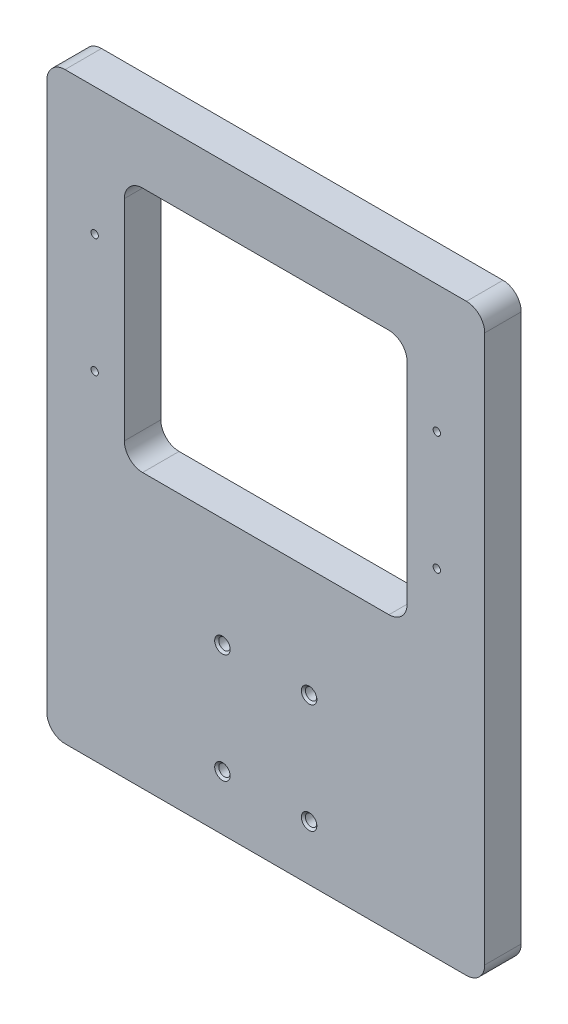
ISO-10303-21;
HEADER;
FILE_DESCRIPTION(('STEP AP214'),'2;1');
FILE_NAME('part.step','',(''),(''),'','','');
FILE_SCHEMA(('AUTOMOTIVE_DESIGN { 1 0 10303 214 1 1 1 1 }'));
ENDSEC;
DATA;
#1=APPLICATION_CONTEXT('core data for automotive mechanical design processes');
#2=APPLICATION_PROTOCOL_DEFINITION('international standard','automotive_design',2000,#1);
#3=PRODUCT_CONTEXT('',#1,'mechanical');
#4=PRODUCT('Part','Part','',(#3));
#5=PRODUCT_RELATED_PRODUCT_CATEGORY('part','',(#4));
#6=PRODUCT_DEFINITION_FORMATION('','',#4);
#7=PRODUCT_DEFINITION_CONTEXT('part definition',#1,'design');
#8=PRODUCT_DEFINITION('design','',#6,#7);
#9=PRODUCT_DEFINITION_SHAPE('','',#8);
#10=(LENGTH_UNIT() NAMED_UNIT(*) SI_UNIT(.MILLI.,.METRE.));
#11=(NAMED_UNIT(*) PLANE_ANGLE_UNIT() SI_UNIT($,.RADIAN.));
#12=(NAMED_UNIT(*) SI_UNIT($,.STERADIAN.) SOLID_ANGLE_UNIT());
#13=UNCERTAINTY_MEASURE_WITH_UNIT(LENGTH_MEASURE(1.E-05),#10,'distance_accuracy_value','');
#14=(GEOMETRIC_REPRESENTATION_CONTEXT(3) GLOBAL_UNCERTAINTY_ASSIGNED_CONTEXT((#13)) GLOBAL_UNIT_ASSIGNED_CONTEXT((#10,
#11,#12)) REPRESENTATION_CONTEXT('',''));
#15=CARTESIAN_POINT('',(0.,0.,0.));
#16=DIRECTION('',(0.,0.,1.));
#17=DIRECTION('',(1.,0.,0.));
#18=AXIS2_PLACEMENT_3D('',#15,#16,#17);
#19=CARTESIAN_POINT('',(0.,0.,25.4));
#20=DIRECTION('',(-1.,0.,0.));
#21=DIRECTION('',(0.,0.,1.));
#22=AXIS2_PLACEMENT_3D('',#19,#20,#21);
#23=PLANE('',#22);
#24=DIRECTION('',(0.,1.,0.));
#25=VECTOR('',#24,1.);
#26=CARTESIAN_POINT('',(0.,0.,0.));
#27=LINE('',#26,#25);
#28=CARTESIAN_POINT('',(0.,12.7,0.));
#29=VERTEX_POINT('',#28);
#30=CARTESIAN_POINT('',(0.,393.7,0.));
#31=VERTEX_POINT('',#30);
#32=EDGE_CURVE('E280',#29,#31,#27,.T.);
#33=ORIENTED_EDGE('',*,*,#32,.F.);
#34=DIRECTION('',(0.,0.,-1.));
#35=VECTOR('',#34,1.);
#36=CARTESIAN_POINT('',(0.,12.7,25.4));
#37=LINE('',#36,#35);
#38=CARTESIAN_POINT('',(0.,12.7,25.4));
#39=VERTEX_POINT('',#38);
#40=EDGE_CURVE('E318',#29,#39,#37,.F.);
#41=ORIENTED_EDGE('',*,*,#40,.T.);
#42=DIRECTION('',(0.,1.,0.));
#43=VECTOR('',#42,1.);
#44=CARTESIAN_POINT('',(0.,0.,25.4));
#45=LINE('',#44,#43);
#46=CARTESIAN_POINT('',(0.,393.7,25.4));
#47=VERTEX_POINT('',#46);
#48=EDGE_CURVE('E281',#39,#47,#45,.T.);
#49=ORIENTED_EDGE('',*,*,#48,.T.);
#50=DIRECTION('',(0.,0.,-1.));
#51=VECTOR('',#50,1.);
#52=CARTESIAN_POINT('',(0.,393.7,25.4));
#53=LINE('',#52,#51);
#54=EDGE_CURVE('E315',#47,#31,#53,.T.);
#55=ORIENTED_EDGE('',*,*,#54,.T.);
#56=EDGE_LOOP('',(#33,#41,#49,#55));
#57=FACE_BOUND('',#56,.T.);
#58=ADVANCED_FACE('F40',(#57),#23,.T.);
#59=CARTESIAN_POINT('',(0.,0.,25.4));
#60=DIRECTION('',(0.,1.,0.));
#61=DIRECTION('',(0.,0.,1.));
#62=AXIS2_PLACEMENT_3D('',#59,#60,#61);
#63=PLANE('',#62);
#64=DIRECTION('',(1.,0.,0.));
#65=VECTOR('',#64,1.);
#66=CARTESIAN_POINT('',(0.,0.,25.4));
#67=LINE('',#66,#65);
#68=CARTESIAN_POINT('',(12.7,0.,25.4));
#69=VERTEX_POINT('',#68);
#70=CARTESIAN_POINT('',(292.1,0.,25.4));
#71=VERTEX_POINT('',#70);
#72=EDGE_CURVE('E289',#69,#71,#67,.T.);
#73=ORIENTED_EDGE('',*,*,#72,.F.);
#74=DIRECTION('',(0.,0.,-1.));
#75=VECTOR('',#74,1.);
#76=CARTESIAN_POINT('',(12.7,0.,0.));
#77=LINE('',#76,#75);
#78=CARTESIAN_POINT('',(12.7,0.,0.));
#79=VERTEX_POINT('',#78);
#80=EDGE_CURVE('E304',#69,#79,#77,.T.);
#81=ORIENTED_EDGE('',*,*,#80,.T.);
#82=DIRECTION('',(1.,0.,0.));
#83=VECTOR('',#82,1.);
#84=CARTESIAN_POINT('',(0.,0.,0.));
#85=LINE('',#84,#83);
#86=CARTESIAN_POINT('',(292.1,0.,0.));
#87=VERTEX_POINT('',#86);
#88=EDGE_CURVE('E285',#79,#87,#85,.T.);
#89=ORIENTED_EDGE('',*,*,#88,.T.);
#90=DIRECTION('',(0.,0.,-1.));
#91=VECTOR('',#90,1.);
#92=CARTESIAN_POINT('',(292.1,0.,25.4));
#93=LINE('',#92,#91);
#94=EDGE_CURVE('E292',#87,#71,#93,.F.);
#95=ORIENTED_EDGE('',*,*,#94,.T.);
#96=EDGE_LOOP('',(#73,#81,#89,#95));
#97=FACE_BOUND('',#96,.T.);
#98=ADVANCED_FACE('F359',(#97),#63,.F.);
#99=CARTESIAN_POINT('',(304.8,0.,25.4));
#100=DIRECTION('',(-1.,0.,0.));
#101=DIRECTION('',(0.,0.,1.));
#102=AXIS2_PLACEMENT_3D('',#99,#100,#101);
#103=PLANE('',#102);
#104=DIRECTION('',(0.,1.,0.));
#105=VECTOR('',#104,1.);
#106=CARTESIAN_POINT('',(304.8,0.,25.4));
#107=LINE('',#106,#105);
#108=CARTESIAN_POINT('',(304.8,12.7,25.4));
#109=VERTEX_POINT('',#108);
#110=CARTESIAN_POINT('',(304.8,393.7,25.4));
#111=VERTEX_POINT('',#110);
#112=EDGE_CURVE('E287',#109,#111,#107,.T.);
#113=ORIENTED_EDGE('',*,*,#112,.F.);
#114=DIRECTION('',(0.,0.,-1.));
#115=VECTOR('',#114,1.);
#116=CARTESIAN_POINT('',(304.8,12.7,25.4));
#117=LINE('',#116,#115);
#118=CARTESIAN_POINT('',(304.8,12.7,0.));
#119=VERTEX_POINT('',#118);
#120=EDGE_CURVE('E329',#109,#119,#117,.T.);
#121=ORIENTED_EDGE('',*,*,#120,.T.);
#122=DIRECTION('',(0.,1.,0.));
#123=VECTOR('',#122,1.);
#124=CARTESIAN_POINT('',(304.8,0.,0.));
#125=LINE('',#124,#123);
#126=CARTESIAN_POINT('',(304.8,393.7,0.));
#127=VERTEX_POINT('',#126);
#128=EDGE_CURVE('E298',#119,#127,#125,.T.);
#129=ORIENTED_EDGE('',*,*,#128,.T.);
#130=DIRECTION('',(0.,0.,-1.));
#131=VECTOR('',#130,1.);
#132=CARTESIAN_POINT('',(304.8,393.7,25.4));
#133=LINE('',#132,#131);
#134=EDGE_CURVE('E327',#127,#111,#133,.F.);
#135=ORIENTED_EDGE('',*,*,#134,.T.);
#136=EDGE_LOOP('',(#113,#121,#129,#135));
#137=FACE_BOUND('',#136,.T.);
#138=ADVANCED_FACE('F335',(#137),#103,.F.);
#139=CARTESIAN_POINT('',(0.,406.4,25.4));
#140=DIRECTION('',(0.,1.,0.));
#141=DIRECTION('',(0.,0.,1.));
#142=AXIS2_PLACEMENT_3D('',#139,#140,#141);
#143=PLANE('',#142);
#144=DIRECTION('',(1.,0.,0.));
#145=VECTOR('',#144,1.);
#146=CARTESIAN_POINT('',(0.,406.4,25.4));
#147=LINE('',#146,#145);
#148=CARTESIAN_POINT('',(12.7,406.4,25.4));
#149=VERTEX_POINT('',#148);
#150=CARTESIAN_POINT('',(292.1,406.4,25.4));
#151=VERTEX_POINT('',#150);
#152=EDGE_CURVE('E284',#149,#151,#147,.T.);
#153=ORIENTED_EDGE('',*,*,#152,.T.);
#154=DIRECTION('',(0.,0.,-1.));
#155=VECTOR('',#154,1.);
#156=CARTESIAN_POINT('',(292.1,406.4,0.));
#157=LINE('',#156,#155);
#158=CARTESIAN_POINT('',(292.1,406.4,0.));
#159=VERTEX_POINT('',#158);
#160=EDGE_CURVE('E11',#151,#159,#157,.T.);
#161=ORIENTED_EDGE('',*,*,#160,.T.);
#162=DIRECTION('',(1.,0.,0.));
#163=VECTOR('',#162,1.);
#164=CARTESIAN_POINT('',(0.,406.4,0.));
#165=LINE('',#164,#163);
#166=CARTESIAN_POINT('',(12.7,406.4,0.));
#167=VERTEX_POINT('',#166);
#168=EDGE_CURVE('E295',#167,#159,#165,.T.);
#169=ORIENTED_EDGE('',*,*,#168,.F.);
#170=DIRECTION('',(0.,0.,-1.));
#171=VECTOR('',#170,1.);
#172=CARTESIAN_POINT('',(12.7,406.4,25.4));
#173=LINE('',#172,#171);
#174=EDGE_CURVE('E48',#167,#149,#173,.F.);
#175=ORIENTED_EDGE('',*,*,#174,.T.);
#176=EDGE_LOOP('',(#153,#161,#169,#175));
#177=FACE_BOUND('',#176,.T.);
#178=ADVANCED_FACE('F344',(#177),#143,.T.);
#179=CARTESIAN_POINT('',(0.,0.,25.4));
#180=DIRECTION('',(0.,0.,-1.));
#181=DIRECTION('',(-1.,0.,0.));
#182=AXIS2_PLACEMENT_3D('',#179,#180,#181);
#183=PLANE('',#182);
#184=CARTESIAN_POINT('',(33.3375,317.5,25.4));
#185=DIRECTION('',(0.,0.,1.));
#186=DIRECTION('',(1.,0.,0.));
#187=AXIS2_PLACEMENT_3D('',#184,#185,#186);
#188=CIRCLE('',#187,2.5527);
#189=CARTESIAN_POINT('',(35.8902,317.5,25.4));
#190=VERTEX_POINT('',#189);
#191=EDGE_CURVE('E485',#190,#190,#188,.T.);
#192=ORIENTED_EDGE('',*,*,#191,.F.);
#193=EDGE_LOOP('',(#192));
#194=FACE_BOUND('',#193,.T.);
#195=CARTESIAN_POINT('',(271.4625,317.5,25.4));
#196=DIRECTION('',(0.,0.,1.));
#197=DIRECTION('',(1.,0.,0.));
#198=AXIS2_PLACEMENT_3D('',#195,#196,#197);
#199=CIRCLE('',#198,2.55270000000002);
#200=CARTESIAN_POINT('',(274.0152,317.5,25.4));
#201=VERTEX_POINT('',#200);
#202=EDGE_CURVE('E487',#201,#201,#199,.T.);
#203=ORIENTED_EDGE('',*,*,#202,.F.);
#204=EDGE_LOOP('',(#203));
#205=FACE_BOUND('',#204,.T.);
#206=CARTESIAN_POINT('',(271.4625,234.95,25.4));
#207=DIRECTION('',(0.,0.,1.));
#208=DIRECTION('',(1.,0.,0.));
#209=AXIS2_PLACEMENT_3D('',#206,#207,#208);
#210=CIRCLE('',#209,2.55270000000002);
#211=CARTESIAN_POINT('',(274.0152,234.95,25.4));
#212=VERTEX_POINT('',#211);
#213=EDGE_CURVE('E495',#212,#212,#210,.T.);
#214=ORIENTED_EDGE('',*,*,#213,.F.);
#215=EDGE_LOOP('',(#214));
#216=FACE_BOUND('',#215,.T.);
#217=CARTESIAN_POINT('',(33.3375,234.95,25.4));
#218=DIRECTION('',(0.,0.,1.));
#219=DIRECTION('',(1.,0.,0.));
#220=AXIS2_PLACEMENT_3D('',#217,#218,#219);
#221=CIRCLE('',#220,2.5527);
#222=CARTESIAN_POINT('',(35.8902,234.95,25.4));
#223=VERTEX_POINT('',#222);
#224=EDGE_CURVE('E500',#223,#223,#221,.T.);
#225=ORIENTED_EDGE('',*,*,#224,.F.);
#226=EDGE_LOOP('',(#225));
#227=FACE_BOUND('',#226,.T.);
#228=DIRECTION('',(1.,0.,0.));
#229=VECTOR('',#228,1.);
#230=CARTESIAN_POINT('',(66.675,190.5,25.4));
#231=LINE('',#230,#229);
#232=CARTESIAN_POINT('',(66.675,190.5,25.4));
#233=VERTEX_POINT('',#232);
#234=CARTESIAN_POINT('',(238.125,190.5,25.4));
#235=VERTEX_POINT('',#234);
#236=EDGE_CURVE('E203',#233,#235,#231,.T.);
#237=ORIENTED_EDGE('',*,*,#236,.F.);
#238=CARTESIAN_POINT('',(66.675,203.2,25.4));
#239=DIRECTION('',(0.,0.,1.));
#240=DIRECTION('',(-1.,0.,0.));
#241=AXIS2_PLACEMENT_3D('',#238,#239,#240);
#242=CIRCLE('',#241,12.7);
#243=CARTESIAN_POINT('',(53.975,203.2,25.4));
#244=VERTEX_POINT('',#243);
#245=EDGE_CURVE('E161',#244,#233,#242,.T.);
#246=ORIENTED_EDGE('',*,*,#245,.F.);
#247=DIRECTION('',(0.,-1.,0.));
#248=VECTOR('',#247,1.);
#249=CARTESIAN_POINT('',(53.975,203.2,25.4));
#250=LINE('',#249,#248);
#251=CARTESIAN_POINT('',(53.975,349.25,25.4));
#252=VERTEX_POINT('',#251);
#253=EDGE_CURVE('E180',#252,#244,#250,.T.);
#254=ORIENTED_EDGE('',*,*,#253,.F.);
#255=CARTESIAN_POINT('',(66.675,349.25,25.4));
#256=DIRECTION('',(0.,0.,1.));
#257=DIRECTION('',(-1.,0.,0.));
#258=AXIS2_PLACEMENT_3D('',#255,#256,#257);
#259=CIRCLE('',#258,12.6999999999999);
#260=CARTESIAN_POINT('',(66.675,361.95,25.4));
#261=VERTEX_POINT('',#260);
#262=EDGE_CURVE('E183',#261,#252,#259,.T.);
#263=ORIENTED_EDGE('',*,*,#262,.F.);
#264=DIRECTION('',(-1.,0.,0.));
#265=VECTOR('',#264,1.);
#266=CARTESIAN_POINT('',(66.675,361.95,25.4));
#267=LINE('',#266,#265);
#268=CARTESIAN_POINT('',(238.125,361.95,25.4));
#269=VERTEX_POINT('',#268);
#270=EDGE_CURVE('E214',#269,#261,#267,.T.);
#271=ORIENTED_EDGE('',*,*,#270,.F.);
#272=CARTESIAN_POINT('',(238.125,349.25,25.4));
#273=DIRECTION('',(0.,0.,1.));
#274=DIRECTION('',(-1.,0.,0.));
#275=AXIS2_PLACEMENT_3D('',#272,#273,#274);
#276=CIRCLE('',#275,12.7);
#277=CARTESIAN_POINT('',(250.825,349.25,25.4));
#278=VERTEX_POINT('',#277);
#279=EDGE_CURVE('E211',#278,#269,#276,.T.);
#280=ORIENTED_EDGE('',*,*,#279,.F.);
#281=DIRECTION('',(0.,1.,0.));
#282=VECTOR('',#281,1.);
#283=CARTESIAN_POINT('',(250.825,203.2,25.4));
#284=LINE('',#283,#282);
#285=CARTESIAN_POINT('',(250.825,203.2,25.4));
#286=VERTEX_POINT('',#285);
#287=EDGE_CURVE('E208',#286,#278,#284,.T.);
#288=ORIENTED_EDGE('',*,*,#287,.F.);
#289=CARTESIAN_POINT('',(238.125,203.2,25.4));
#290=DIRECTION('',(0.,0.,1.));
#291=DIRECTION('',(1.,0.,0.));
#292=AXIS2_PLACEMENT_3D('',#289,#290,#291);
#293=CIRCLE('',#292,12.7);
#294=EDGE_CURVE('E205',#235,#286,#293,.T.);
#295=ORIENTED_EDGE('',*,*,#294,.F.);
#296=EDGE_LOOP('',(#237,#246,#254,#263,#271,#280,#288,#295));
#297=FACE_BOUND('',#296,.T.);
#298=CARTESIAN_POINT('',(122.2375,38.1,25.4));
#299=DIRECTION('',(0.,0.,1.));
#300=DIRECTION('',(1.,0.,0.));
#301=AXIS2_PLACEMENT_3D('',#298,#299,#300);
#302=CIRCLE('',#301,5.3975);
#303=CARTESIAN_POINT('',(127.635,38.1,25.4));
#304=VERTEX_POINT('',#303);
#305=EDGE_CURVE('E235',#304,#304,#302,.T.);
#306=ORIENTED_EDGE('',*,*,#305,.F.);
#307=EDGE_LOOP('',(#306));
#308=FACE_BOUND('',#307,.T.);
#309=CARTESIAN_POINT('',(122.2375,114.3,25.4));
#310=DIRECTION('',(0.,0.,1.));
#311=DIRECTION('',(1.,0.,0.));
#312=AXIS2_PLACEMENT_3D('',#309,#310,#311);
#313=CIRCLE('',#312,5.3975);
#314=CARTESIAN_POINT('',(127.635,114.3,25.4));
#315=VERTEX_POINT('',#314);
#316=EDGE_CURVE('E247',#315,#315,#313,.T.);
#317=ORIENTED_EDGE('',*,*,#316,.F.);
#318=EDGE_LOOP('',(#317));
#319=FACE_BOUND('',#318,.T.);
#320=CARTESIAN_POINT('',(182.5625,38.1000000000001,25.4));
#321=DIRECTION('',(0.,0.,1.));
#322=DIRECTION('',(1.,0.,0.));
#323=AXIS2_PLACEMENT_3D('',#320,#321,#322);
#324=CIRCLE('',#323,5.3975);
#325=CARTESIAN_POINT('',(187.96,38.1000000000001,25.4));
#326=VERTEX_POINT('',#325);
#327=EDGE_CURVE('E259',#326,#326,#324,.T.);
#328=ORIENTED_EDGE('',*,*,#327,.F.);
#329=EDGE_LOOP('',(#328));
#330=FACE_BOUND('',#329,.T.);
#331=CARTESIAN_POINT('',(182.5625,114.3,25.4));
#332=DIRECTION('',(0.,0.,1.));
#333=DIRECTION('',(1.,0.,0.));
#334=AXIS2_PLACEMENT_3D('',#331,#332,#333);
#335=CIRCLE('',#334,5.3975);
#336=CARTESIAN_POINT('',(187.96,114.3,25.4));
#337=VERTEX_POINT('',#336);
#338=EDGE_CURVE('E271',#337,#337,#335,.T.);
#339=ORIENTED_EDGE('',*,*,#338,.F.);
#340=EDGE_LOOP('',(#339));
#341=FACE_BOUND('',#340,.T.);
#342=ORIENTED_EDGE('',*,*,#48,.F.);
#343=CARTESIAN_POINT('',(12.7,12.7,25.4));
#344=DIRECTION('',(0.,0.,-1.));
#345=DIRECTION('',(-1.,0.,0.));
#346=AXIS2_PLACEMENT_3D('',#343,#344,#345);
#347=CIRCLE('',#346,12.7);
#348=EDGE_CURVE('E325',#39,#69,#347,.F.);
#349=ORIENTED_EDGE('',*,*,#348,.T.);
#350=ORIENTED_EDGE('',*,*,#72,.T.);
#351=CARTESIAN_POINT('',(292.1,12.7,25.4));
#352=DIRECTION('',(0.,0.,-1.));
#353=DIRECTION('',(-1.,0.,0.));
#354=AXIS2_PLACEMENT_3D('',#351,#352,#353);
#355=CIRCLE('',#354,12.7);
#356=EDGE_CURVE('E323',#71,#109,#355,.F.);
#357=ORIENTED_EDGE('',*,*,#356,.T.);
#358=ORIENTED_EDGE('',*,*,#112,.T.);
#359=CARTESIAN_POINT('',(292.1,393.7,25.4));
#360=DIRECTION('',(0.,0.,-1.));
#361=DIRECTION('',(-1.,0.,0.));
#362=AXIS2_PLACEMENT_3D('',#359,#360,#361);
#363=CIRCLE('',#362,12.7);
#364=EDGE_CURVE('E55',#111,#151,#363,.F.);
#365=ORIENTED_EDGE('',*,*,#364,.T.);
#366=ORIENTED_EDGE('',*,*,#152,.F.);
#367=CARTESIAN_POINT('',(12.7,393.7,25.4));
#368=DIRECTION('',(0.,0.,-1.));
#369=DIRECTION('',(-1.,0.,0.));
#370=AXIS2_PLACEMENT_3D('',#367,#368,#369);
#371=CIRCLE('',#370,12.7);
#372=EDGE_CURVE('E320',#149,#47,#371,.F.);
#373=ORIENTED_EDGE('',*,*,#372,.T.);
#374=EDGE_LOOP('',(#342,#349,#350,#357,#358,#365,#366,#373));
#375=FACE_BOUND('',#374,.T.);
#376=ADVANCED_FACE('F347',(#194,#205,#216,#227,#297,#308,#319,#330,#341,#375),#183,.F.);
#377=CARTESIAN_POINT('',(0.,0.,0.));
#378=DIRECTION('',(0.,0.,-1.));
#379=DIRECTION('',(-1.,0.,0.));
#380=AXIS2_PLACEMENT_3D('',#377,#378,#379);
#381=PLANE('',#380);
#382=CARTESIAN_POINT('',(33.3375,317.5,0.));
#383=DIRECTION('',(0.,0.,1.));
#384=DIRECTION('',(1.,0.,0.));
#385=AXIS2_PLACEMENT_3D('',#382,#383,#384);
#386=CIRCLE('',#385,2.55269999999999);
#387=CARTESIAN_POINT('',(35.8902,317.5,0.));
#388=VERTEX_POINT('',#387);
#389=EDGE_CURVE('E482',#388,#388,#386,.T.);
#390=ORIENTED_EDGE('',*,*,#389,.T.);
#391=EDGE_LOOP('',(#390));
#392=FACE_BOUND('',#391,.T.);
#393=CARTESIAN_POINT('',(271.4625,317.5,0.));
#394=DIRECTION('',(0.,0.,1.));
#395=DIRECTION('',(1.,0.,0.));
#396=AXIS2_PLACEMENT_3D('',#393,#394,#395);
#397=CIRCLE('',#396,2.55270000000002);
#398=CARTESIAN_POINT('',(274.0152,317.5,0.));
#399=VERTEX_POINT('',#398);
#400=EDGE_CURVE('E492',#399,#399,#397,.T.);
#401=ORIENTED_EDGE('',*,*,#400,.T.);
#402=EDGE_LOOP('',(#401));
#403=FACE_BOUND('',#402,.T.);
#404=CARTESIAN_POINT('',(271.4625,234.95,0.));
#405=DIRECTION('',(0.,0.,1.));
#406=DIRECTION('',(1.,0.,0.));
#407=AXIS2_PLACEMENT_3D('',#404,#405,#406);
#408=CIRCLE('',#407,2.55270000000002);
#409=CARTESIAN_POINT('',(274.0152,234.95,0.));
#410=VERTEX_POINT('',#409);
#411=EDGE_CURVE('E498',#410,#410,#408,.T.);
#412=ORIENTED_EDGE('',*,*,#411,.T.);
#413=EDGE_LOOP('',(#412));
#414=FACE_BOUND('',#413,.T.);
#415=CARTESIAN_POINT('',(33.3375,234.95,0.));
#416=DIRECTION('',(0.,0.,1.));
#417=DIRECTION('',(1.,0.,0.));
#418=AXIS2_PLACEMENT_3D('',#415,#416,#417);
#419=CIRCLE('',#418,2.55269999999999);
#420=CARTESIAN_POINT('',(35.8902,234.95,0.));
#421=VERTEX_POINT('',#420);
#422=EDGE_CURVE('E186',#421,#421,#419,.T.);
#423=ORIENTED_EDGE('',*,*,#422,.T.);
#424=EDGE_LOOP('',(#423));
#425=FACE_BOUND('',#424,.T.);
#426=CARTESIAN_POINT('',(66.675,203.2,0.));
#427=DIRECTION('',(0.,0.,1.));
#428=DIRECTION('',(-1.,0.,0.));
#429=AXIS2_PLACEMENT_3D('',#426,#427,#428);
#430=CIRCLE('',#429,12.7);
#431=CARTESIAN_POINT('',(53.975,203.2,0.));
#432=VERTEX_POINT('',#431);
#433=CARTESIAN_POINT('',(66.675,190.5,0.));
#434=VERTEX_POINT('',#433);
#435=EDGE_CURVE('E158',#432,#434,#430,.T.);
#436=ORIENTED_EDGE('',*,*,#435,.T.);
#437=DIRECTION('',(1.,0.,0.));
#438=VECTOR('',#437,1.);
#439=CARTESIAN_POINT('',(66.675,190.5,0.));
#440=LINE('',#439,#438);
#441=CARTESIAN_POINT('',(238.125,190.5,0.));
#442=VERTEX_POINT('',#441);
#443=EDGE_CURVE('E170',#434,#442,#440,.T.);
#444=ORIENTED_EDGE('',*,*,#443,.T.);
#445=CARTESIAN_POINT('',(238.125,203.2,0.));
#446=DIRECTION('',(0.,0.,1.));
#447=DIRECTION('',(1.,0.,0.));
#448=AXIS2_PLACEMENT_3D('',#445,#446,#447);
#449=CIRCLE('',#448,12.7);
#450=CARTESIAN_POINT('',(250.825,203.2,0.));
#451=VERTEX_POINT('',#450);
#452=EDGE_CURVE('E174',#442,#451,#449,.T.);
#453=ORIENTED_EDGE('',*,*,#452,.T.);
#454=DIRECTION('',(0.,1.,0.));
#455=VECTOR('',#454,1.);
#456=CARTESIAN_POINT('',(250.825,203.2,0.));
#457=LINE('',#456,#455);
#458=CARTESIAN_POINT('',(250.825,349.25,0.));
#459=VERTEX_POINT('',#458);
#460=EDGE_CURVE('E190',#451,#459,#457,.T.);
#461=ORIENTED_EDGE('',*,*,#460,.T.);
#462=CARTESIAN_POINT('',(238.125,349.25,0.));
#463=DIRECTION('',(0.,0.,1.));
#464=DIRECTION('',(-1.,0.,0.));
#465=AXIS2_PLACEMENT_3D('',#462,#463,#464);
#466=CIRCLE('',#465,12.7);
#467=CARTESIAN_POINT('',(238.125,361.95,0.));
#468=VERTEX_POINT('',#467);
#469=EDGE_CURVE('E193',#459,#468,#466,.T.);
#470=ORIENTED_EDGE('',*,*,#469,.T.);
#471=DIRECTION('',(-1.,0.,0.));
#472=VECTOR('',#471,1.);
#473=CARTESIAN_POINT('',(66.675,361.95,0.));
#474=LINE('',#473,#472);
#475=CARTESIAN_POINT('',(66.675,361.95,0.));
#476=VERTEX_POINT('',#475);
#477=EDGE_CURVE('E196',#468,#476,#474,.T.);
#478=ORIENTED_EDGE('',*,*,#477,.T.);
#479=CARTESIAN_POINT('',(66.675,349.25,0.));
#480=DIRECTION('',(0.,0.,1.));
#481=DIRECTION('',(-1.,0.,0.));
#482=AXIS2_PLACEMENT_3D('',#479,#480,#481);
#483=CIRCLE('',#482,12.6999999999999);
#484=CARTESIAN_POINT('',(53.975,349.25,0.));
#485=VERTEX_POINT('',#484);
#486=EDGE_CURVE('E199',#476,#485,#483,.T.);
#487=ORIENTED_EDGE('',*,*,#486,.T.);
#488=DIRECTION('',(0.,-1.,0.));
#489=VECTOR('',#488,1.);
#490=CARTESIAN_POINT('',(53.975,203.2,0.));
#491=LINE('',#490,#489);
#492=EDGE_CURVE('E166',#485,#432,#491,.T.);
#493=ORIENTED_EDGE('',*,*,#492,.T.);
#494=EDGE_LOOP('',(#436,#444,#453,#461,#470,#478,#487,#493));
#495=FACE_BOUND('',#494,.T.);
#496=CARTESIAN_POINT('',(122.2375,38.1,0.));
#497=DIRECTION('',(0.,0.,1.));
#498=DIRECTION('',(1.,0.,0.));
#499=AXIS2_PLACEMENT_3D('',#496,#497,#498);
#500=CIRCLE('',#499,5.3975);
#501=CARTESIAN_POINT('',(127.635,38.1,0.));
#502=VERTEX_POINT('',#501);
#503=EDGE_CURVE('E221',#502,#502,#500,.T.);
#504=ORIENTED_EDGE('',*,*,#503,.T.);
#505=EDGE_LOOP('',(#504));
#506=FACE_BOUND('',#505,.T.);
#507=CARTESIAN_POINT('',(122.2375,114.3,0.));
#508=DIRECTION('',(0.,0.,1.));
#509=DIRECTION('',(1.,0.,0.));
#510=AXIS2_PLACEMENT_3D('',#507,#508,#509);
#511=CIRCLE('',#510,5.3975);
#512=CARTESIAN_POINT('',(127.635,114.3,0.));
#513=VERTEX_POINT('',#512);
#514=EDGE_CURVE('E244',#513,#513,#511,.T.);
#515=ORIENTED_EDGE('',*,*,#514,.T.);
#516=EDGE_LOOP('',(#515));
#517=FACE_BOUND('',#516,.T.);
#518=CARTESIAN_POINT('',(182.5625,38.1000000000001,0.));
#519=DIRECTION('',(0.,0.,1.));
#520=DIRECTION('',(1.,0.,0.));
#521=AXIS2_PLACEMENT_3D('',#518,#519,#520);
#522=CIRCLE('',#521,5.3975);
#523=CARTESIAN_POINT('',(187.96,38.1000000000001,0.));
#524=VERTEX_POINT('',#523);
#525=EDGE_CURVE('E256',#524,#524,#522,.T.);
#526=ORIENTED_EDGE('',*,*,#525,.T.);
#527=EDGE_LOOP('',(#526));
#528=FACE_BOUND('',#527,.T.);
#529=CARTESIAN_POINT('',(182.5625,114.3,0.));
#530=DIRECTION('',(0.,0.,1.));
#531=DIRECTION('',(1.,0.,0.));
#532=AXIS2_PLACEMENT_3D('',#529,#530,#531);
#533=CIRCLE('',#532,5.3975);
#534=CARTESIAN_POINT('',(187.96,114.3,0.));
#535=VERTEX_POINT('',#534);
#536=EDGE_CURVE('E268',#535,#535,#533,.T.);
#537=ORIENTED_EDGE('',*,*,#536,.T.);
#538=EDGE_LOOP('',(#537));
#539=FACE_BOUND('',#538,.T.);
#540=ORIENTED_EDGE('',*,*,#88,.F.);
#541=CARTESIAN_POINT('',(12.7,12.7,0.));
#542=DIRECTION('',(0.,0.,-1.));
#543=DIRECTION('',(-1.,0.,0.));
#544=AXIS2_PLACEMENT_3D('',#541,#542,#543);
#545=CIRCLE('',#544,12.7);
#546=EDGE_CURVE('E313',#79,#29,#545,.T.);
#547=ORIENTED_EDGE('',*,*,#546,.T.);
#548=ORIENTED_EDGE('',*,*,#32,.T.);
#549=CARTESIAN_POINT('',(12.7,393.7,0.));
#550=DIRECTION('',(0.,0.,-1.));
#551=DIRECTION('',(-1.,0.,0.));
#552=AXIS2_PLACEMENT_3D('',#549,#550,#551);
#553=CIRCLE('',#552,12.7);
#554=EDGE_CURVE('E307',#31,#167,#553,.T.);
#555=ORIENTED_EDGE('',*,*,#554,.T.);
#556=ORIENTED_EDGE('',*,*,#168,.T.);
#557=CARTESIAN_POINT('',(292.1,393.7,0.));
#558=DIRECTION('',(0.,0.,-1.));
#559=DIRECTION('',(-1.,0.,0.));
#560=AXIS2_PLACEMENT_3D('',#557,#558,#559);
#561=CIRCLE('',#560,12.7);
#562=EDGE_CURVE('E309',#159,#127,#561,.T.);
#563=ORIENTED_EDGE('',*,*,#562,.T.);
#564=ORIENTED_EDGE('',*,*,#128,.F.);
#565=CARTESIAN_POINT('',(292.1,12.7,0.));
#566=DIRECTION('',(0.,0.,-1.));
#567=DIRECTION('',(-1.,0.,0.));
#568=AXIS2_PLACEMENT_3D('',#565,#566,#567);
#569=CIRCLE('',#568,12.7);
#570=EDGE_CURVE('E311',#119,#87,#569,.T.);
#571=ORIENTED_EDGE('',*,*,#570,.T.);
#572=EDGE_LOOP('',(#540,#547,#548,#555,#556,#563,#564,#571));
#573=FACE_BOUND('',#572,.T.);
#574=ADVANCED_FACE('F176',(#392,#403,#414,#425,#495,#506,#517,#528,#539,#573),#381,.T.);
#575=CARTESIAN_POINT('',(182.5625,114.3,1.42875));
#576=DIRECTION('',(0.,0.,-1.));
#577=DIRECTION('',(-1.,0.,0.));
#578=AXIS2_PLACEMENT_3D('',#575,#576,#577);
#579=CONICAL_SURFACE('',#578,3.96874999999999,0.78539816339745);
#580=ORIENTED_EDGE('',*,*,#536,.F.);
#581=EDGE_LOOP('',(#580));
#582=FACE_BOUND('',#581,.T.);
#583=CARTESIAN_POINT('',(182.5625,114.3,1.42875));
#584=DIRECTION('',(0.,0.,1.));
#585=DIRECTION('',(1.,0.,0.));
#586=AXIS2_PLACEMENT_3D('',#583,#584,#585);
#587=CIRCLE('',#586,3.96874999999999);
#588=CARTESIAN_POINT('',(186.53125,114.3,1.42875));
#589=VERTEX_POINT('',#588);
#590=EDGE_CURVE('E277',#589,#589,#587,.T.);
#591=ORIENTED_EDGE('',*,*,#590,.T.);
#592=EDGE_LOOP('',(#591));
#593=FACE_BOUND('',#592,.T.);
#594=ADVANCED_FACE('F383',(#582,#593),#579,.F.);
#595=CARTESIAN_POINT('',(182.5625,114.3,25.4));
#596=DIRECTION('',(0.,0.,1.));
#597=DIRECTION('',(1.,0.,0.));
#598=AXIS2_PLACEMENT_3D('',#595,#596,#597);
#599=CYLINDRICAL_SURFACE('',#598,3.96874999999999);
#600=ORIENTED_EDGE('',*,*,#590,.F.);
#601=EDGE_LOOP('',(#600));
#602=FACE_BOUND('',#601,.T.);
#603=CARTESIAN_POINT('',(182.5625,114.3,23.97125));
#604=DIRECTION('',(0.,0.,1.));
#605=DIRECTION('',(1.,0.,0.));
#606=AXIS2_PLACEMENT_3D('',#603,#604,#605);
#607=CIRCLE('',#606,3.96874999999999);
#608=CARTESIAN_POINT('',(186.53125,114.3,23.97125));
#609=VERTEX_POINT('',#608);
#610=EDGE_CURVE('E274',#609,#609,#607,.T.);
#611=ORIENTED_EDGE('',*,*,#610,.T.);
#612=EDGE_LOOP('',(#611));
#613=FACE_BOUND('',#612,.T.);
#614=ADVANCED_FACE('F390',(#602,#613),#599,.F.);
#615=CARTESIAN_POINT('',(182.5625,114.3,25.4));
#616=DIRECTION('',(0.,0.,1.));
#617=DIRECTION('',(1.,0.,0.));
#618=AXIS2_PLACEMENT_3D('',#615,#616,#617);
#619=CONICAL_SURFACE('',#618,5.3975,0.785398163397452);
#620=ORIENTED_EDGE('',*,*,#610,.F.);
#621=EDGE_LOOP('',(#620));
#622=FACE_BOUND('',#621,.T.);
#623=ORIENTED_EDGE('',*,*,#338,.T.);
#624=EDGE_LOOP('',(#623));
#625=FACE_BOUND('',#624,.T.);
#626=ADVANCED_FACE('F394',(#622,#625),#619,.F.);
#627=CARTESIAN_POINT('',(182.5625,38.1000000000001,1.42875));
#628=DIRECTION('',(0.,0.,-1.));
#629=DIRECTION('',(-1.,0.,0.));
#630=AXIS2_PLACEMENT_3D('',#627,#628,#629);
#631=CONICAL_SURFACE('',#630,3.96874999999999,0.78539816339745);
#632=ORIENTED_EDGE('',*,*,#525,.F.);
#633=EDGE_LOOP('',(#632));
#634=FACE_BOUND('',#633,.T.);
#635=CARTESIAN_POINT('',(182.5625,38.1000000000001,1.42875));
#636=DIRECTION('',(0.,0.,1.));
#637=DIRECTION('',(1.,0.,0.));
#638=AXIS2_PLACEMENT_3D('',#635,#636,#637);
#639=CIRCLE('',#638,3.96874999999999);
#640=CARTESIAN_POINT('',(186.53125,38.1000000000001,1.42875));
#641=VERTEX_POINT('',#640);
#642=EDGE_CURVE('E265',#641,#641,#639,.T.);
#643=ORIENTED_EDGE('',*,*,#642,.T.);
#644=EDGE_LOOP('',(#643));
#645=FACE_BOUND('',#644,.T.);
#646=ADVANCED_FACE('F398',(#634,#645),#631,.F.);
#647=CARTESIAN_POINT('',(182.5625,38.1000000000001,25.4));
#648=DIRECTION('',(0.,0.,1.));
#649=DIRECTION('',(1.,0.,0.));
#650=AXIS2_PLACEMENT_3D('',#647,#648,#649);
#651=CYLINDRICAL_SURFACE('',#650,3.96874999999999);
#652=ORIENTED_EDGE('',*,*,#642,.F.);
#653=EDGE_LOOP('',(#652));
#654=FACE_BOUND('',#653,.T.);
#655=CARTESIAN_POINT('',(182.5625,38.1000000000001,23.97125));
#656=DIRECTION('',(0.,0.,1.));
#657=DIRECTION('',(1.,0.,0.));
#658=AXIS2_PLACEMENT_3D('',#655,#656,#657);
#659=CIRCLE('',#658,3.96874999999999);
#660=CARTESIAN_POINT('',(186.53125,38.1000000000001,23.97125));
#661=VERTEX_POINT('',#660);
#662=EDGE_CURVE('E262',#661,#661,#659,.T.);
#663=ORIENTED_EDGE('',*,*,#662,.T.);
#664=EDGE_LOOP('',(#663));
#665=FACE_BOUND('',#664,.T.);
#666=ADVANCED_FACE('F402',(#654,#665),#651,.F.);
#667=CARTESIAN_POINT('',(182.5625,38.1000000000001,25.4));
#668=DIRECTION('',(0.,0.,1.));
#669=DIRECTION('',(1.,0.,0.));
#670=AXIS2_PLACEMENT_3D('',#667,#668,#669);
#671=CONICAL_SURFACE('',#670,5.3975,0.785398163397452);
#672=ORIENTED_EDGE('',*,*,#662,.F.);
#673=EDGE_LOOP('',(#672));
#674=FACE_BOUND('',#673,.T.);
#675=ORIENTED_EDGE('',*,*,#327,.T.);
#676=EDGE_LOOP('',(#675));
#677=FACE_BOUND('',#676,.T.);
#678=ADVANCED_FACE('F406',(#674,#677),#671,.F.);
#679=CARTESIAN_POINT('',(122.2375,114.3,1.42875));
#680=DIRECTION('',(0.,0.,-1.));
#681=DIRECTION('',(-1.,0.,0.));
#682=AXIS2_PLACEMENT_3D('',#679,#680,#681);
#683=CONICAL_SURFACE('',#682,3.96874999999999,0.78539816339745);
#684=ORIENTED_EDGE('',*,*,#514,.F.);
#685=EDGE_LOOP('',(#684));
#686=FACE_BOUND('',#685,.T.);
#687=CARTESIAN_POINT('',(122.2375,114.3,1.42875));
#688=DIRECTION('',(0.,0.,1.));
#689=DIRECTION('',(1.,0.,0.));
#690=AXIS2_PLACEMENT_3D('',#687,#688,#689);
#691=CIRCLE('',#690,3.96874999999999);
#692=CARTESIAN_POINT('',(126.20625,114.3,1.42875));
#693=VERTEX_POINT('',#692);
#694=EDGE_CURVE('E253',#693,#693,#691,.T.);
#695=ORIENTED_EDGE('',*,*,#694,.T.);
#696=EDGE_LOOP('',(#695));
#697=FACE_BOUND('',#696,.T.);
#698=ADVANCED_FACE('F410',(#686,#697),#683,.F.);
#699=CARTESIAN_POINT('',(122.2375,114.3,25.4));
#700=DIRECTION('',(0.,0.,1.));
#701=DIRECTION('',(1.,0.,0.));
#702=AXIS2_PLACEMENT_3D('',#699,#700,#701);
#703=CYLINDRICAL_SURFACE('',#702,3.96874999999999);
#704=ORIENTED_EDGE('',*,*,#694,.F.);
#705=EDGE_LOOP('',(#704));
#706=FACE_BOUND('',#705,.T.);
#707=CARTESIAN_POINT('',(122.2375,114.3,23.97125));
#708=DIRECTION('',(0.,0.,1.));
#709=DIRECTION('',(1.,0.,0.));
#710=AXIS2_PLACEMENT_3D('',#707,#708,#709);
#711=CIRCLE('',#710,3.96874999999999);
#712=CARTESIAN_POINT('',(126.20625,114.3,23.97125));
#713=VERTEX_POINT('',#712);
#714=EDGE_CURVE('E250',#713,#713,#711,.T.);
#715=ORIENTED_EDGE('',*,*,#714,.T.);
#716=EDGE_LOOP('',(#715));
#717=FACE_BOUND('',#716,.T.);
#718=ADVANCED_FACE('F414',(#706,#717),#703,.F.);
#719=CARTESIAN_POINT('',(122.2375,114.3,25.4));
#720=DIRECTION('',(0.,0.,1.));
#721=DIRECTION('',(1.,0.,0.));
#722=AXIS2_PLACEMENT_3D('',#719,#720,#721);
#723=CONICAL_SURFACE('',#722,5.3975,0.785398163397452);
#724=ORIENTED_EDGE('',*,*,#714,.F.);
#725=EDGE_LOOP('',(#724));
#726=FACE_BOUND('',#725,.T.);
#727=ORIENTED_EDGE('',*,*,#316,.T.);
#728=EDGE_LOOP('',(#727));
#729=FACE_BOUND('',#728,.T.);
#730=ADVANCED_FACE('F418',(#726,#729),#723,.F.);
#731=CARTESIAN_POINT('',(122.2375,38.1,1.42875));
#732=DIRECTION('',(0.,0.,-1.));
#733=DIRECTION('',(-1.,0.,0.));
#734=AXIS2_PLACEMENT_3D('',#731,#732,#733);
#735=CONICAL_SURFACE('',#734,3.96874999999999,0.78539816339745);
#736=ORIENTED_EDGE('',*,*,#503,.F.);
#737=EDGE_LOOP('',(#736));
#738=FACE_BOUND('',#737,.T.);
#739=CARTESIAN_POINT('',(122.2375,38.1,1.42875));
#740=DIRECTION('',(0.,0.,1.));
#741=DIRECTION('',(1.,0.,0.));
#742=AXIS2_PLACEMENT_3D('',#739,#740,#741);
#743=CIRCLE('',#742,3.96874999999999);
#744=CARTESIAN_POINT('',(126.20625,38.1,1.42875));
#745=VERTEX_POINT('',#744);
#746=EDGE_CURVE('E241',#745,#745,#743,.T.);
#747=ORIENTED_EDGE('',*,*,#746,.T.);
#748=EDGE_LOOP('',(#747));
#749=FACE_BOUND('',#748,.T.);
#750=ADVANCED_FACE('F422',(#738,#749),#735,.F.);
#751=CARTESIAN_POINT('',(122.2375,38.1,25.4));
#752=DIRECTION('',(0.,0.,1.));
#753=DIRECTION('',(1.,0.,0.));
#754=AXIS2_PLACEMENT_3D('',#751,#752,#753);
#755=CYLINDRICAL_SURFACE('',#754,3.96874999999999);
#756=ORIENTED_EDGE('',*,*,#746,.F.);
#757=EDGE_LOOP('',(#756));
#758=FACE_BOUND('',#757,.T.);
#759=CARTESIAN_POINT('',(122.2375,38.1,23.97125));
#760=DIRECTION('',(0.,0.,1.));
#761=DIRECTION('',(1.,0.,0.));
#762=AXIS2_PLACEMENT_3D('',#759,#760,#761);
#763=CIRCLE('',#762,3.96874999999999);
#764=CARTESIAN_POINT('',(126.20625,38.1,23.97125));
#765=VERTEX_POINT('',#764);
#766=EDGE_CURVE('E238',#765,#765,#763,.T.);
#767=ORIENTED_EDGE('',*,*,#766,.T.);
#768=EDGE_LOOP('',(#767));
#769=FACE_BOUND('',#768,.T.);
#770=ADVANCED_FACE('F426',(#758,#769),#755,.F.);
#771=CARTESIAN_POINT('',(122.2375,38.1,25.4));
#772=DIRECTION('',(0.,0.,1.));
#773=DIRECTION('',(1.,0.,0.));
#774=AXIS2_PLACEMENT_3D('',#771,#772,#773);
#775=CONICAL_SURFACE('',#774,5.3975,0.785398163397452);
#776=ORIENTED_EDGE('',*,*,#766,.F.);
#777=EDGE_LOOP('',(#776));
#778=FACE_BOUND('',#777,.T.);
#779=ORIENTED_EDGE('',*,*,#305,.T.);
#780=EDGE_LOOP('',(#779));
#781=FACE_BOUND('',#780,.T.);
#782=ADVANCED_FACE('F430',(#778,#781),#775,.F.);
#783=CARTESIAN_POINT('',(66.675,203.2,0.));
#784=DIRECTION('',(0.,0.,1.));
#785=DIRECTION('',(1.,0.,0.));
#786=AXIS2_PLACEMENT_3D('',#783,#784,#785);
#787=CYLINDRICAL_SURFACE('',#786,12.7);
#788=ORIENTED_EDGE('',*,*,#245,.T.);
#789=DIRECTION('',(0.,0.,1.));
#790=VECTOR('',#789,1.);
#791=CARTESIAN_POINT('',(66.675,190.5,0.));
#792=LINE('',#791,#790);
#793=EDGE_CURVE('E154',#434,#233,#792,.T.);
#794=ORIENTED_EDGE('',*,*,#793,.F.);
#795=ORIENTED_EDGE('',*,*,#435,.F.);
#796=DIRECTION('',(0.,0.,1.));
#797=VECTOR('',#796,1.);
#798=CARTESIAN_POINT('',(53.975,203.2,0.));
#799=LINE('',#798,#797);
#800=EDGE_CURVE('E219',#432,#244,#799,.T.);
#801=ORIENTED_EDGE('',*,*,#800,.T.);
#802=EDGE_LOOP('',(#788,#794,#795,#801));
#803=FACE_BOUND('',#802,.T.);
#804=ADVANCED_FACE('F156',(#803),#787,.F.);
#805=CARTESIAN_POINT('',(53.975,203.2,0.));
#806=DIRECTION('',(-1.,0.,0.));
#807=DIRECTION('',(0.,-1.,0.));
#808=AXIS2_PLACEMENT_3D('',#805,#806,#807);
#809=PLANE('',#808);
#810=ORIENTED_EDGE('',*,*,#253,.T.);
#811=ORIENTED_EDGE('',*,*,#800,.F.);
#812=ORIENTED_EDGE('',*,*,#492,.F.);
#813=DIRECTION('',(0.,0.,1.));
#814=VECTOR('',#813,1.);
#815=CARTESIAN_POINT('',(53.975,349.25,0.));
#816=LINE('',#815,#814);
#817=EDGE_CURVE('E222',#485,#252,#816,.T.);
#818=ORIENTED_EDGE('',*,*,#817,.T.);
#819=EDGE_LOOP('',(#810,#811,#812,#818));
#820=FACE_BOUND('',#819,.T.);
#821=ADVANCED_FACE('F437',(#820),#809,.F.);
#822=CARTESIAN_POINT('',(66.675,349.25,0.));
#823=DIRECTION('',(0.,0.,1.));
#824=DIRECTION('',(1.,0.,0.));
#825=AXIS2_PLACEMENT_3D('',#822,#823,#824);
#826=CYLINDRICAL_SURFACE('',#825,12.6999999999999);
#827=ORIENTED_EDGE('',*,*,#262,.T.);
#828=ORIENTED_EDGE('',*,*,#817,.F.);
#829=ORIENTED_EDGE('',*,*,#486,.F.);
#830=DIRECTION('',(0.,0.,1.));
#831=VECTOR('',#830,1.);
#832=CARTESIAN_POINT('',(66.675,361.95,0.));
#833=LINE('',#832,#831);
#834=EDGE_CURVE('E224',#476,#261,#833,.T.);
#835=ORIENTED_EDGE('',*,*,#834,.T.);
#836=EDGE_LOOP('',(#827,#828,#829,#835));
#837=FACE_BOUND('',#836,.T.);
#838=ADVANCED_FACE('F456',(#837),#826,.F.);
#839=CARTESIAN_POINT('',(66.675,361.95,0.));
#840=DIRECTION('',(0.,1.,0.));
#841=DIRECTION('',(-1.,0.,0.));
#842=AXIS2_PLACEMENT_3D('',#839,#840,#841);
#843=PLANE('',#842);
#844=ORIENTED_EDGE('',*,*,#270,.T.);
#845=ORIENTED_EDGE('',*,*,#834,.F.);
#846=ORIENTED_EDGE('',*,*,#477,.F.);
#847=DIRECTION('',(0.,0.,1.));
#848=VECTOR('',#847,1.);
#849=CARTESIAN_POINT('',(238.125,361.95,0.));
#850=LINE('',#849,#848);
#851=EDGE_CURVE('E226',#468,#269,#850,.T.);
#852=ORIENTED_EDGE('',*,*,#851,.T.);
#853=EDGE_LOOP('',(#844,#845,#846,#852));
#854=FACE_BOUND('',#853,.T.);
#855=ADVANCED_FACE('F452',(#854),#843,.F.);
#856=CARTESIAN_POINT('',(238.125,349.25,0.));
#857=DIRECTION('',(0.,0.,1.));
#858=DIRECTION('',(1.,0.,0.));
#859=AXIS2_PLACEMENT_3D('',#856,#857,#858);
#860=CYLINDRICAL_SURFACE('',#859,12.7);
#861=ORIENTED_EDGE('',*,*,#279,.T.);
#862=ORIENTED_EDGE('',*,*,#851,.F.);
#863=ORIENTED_EDGE('',*,*,#469,.F.);
#864=DIRECTION('',(0.,0.,1.));
#865=VECTOR('',#864,1.);
#866=CARTESIAN_POINT('',(250.825,349.25,0.));
#867=LINE('',#866,#865);
#868=EDGE_CURVE('E228',#459,#278,#867,.T.);
#869=ORIENTED_EDGE('',*,*,#868,.T.);
#870=EDGE_LOOP('',(#861,#862,#863,#869));
#871=FACE_BOUND('',#870,.T.);
#872=ADVANCED_FACE('F448',(#871),#860,.F.);
#873=CARTESIAN_POINT('',(250.825,203.2,0.));
#874=DIRECTION('',(1.,0.,0.));
#875=DIRECTION('',(0.,0.,-1.));
#876=AXIS2_PLACEMENT_3D('',#873,#874,#875);
#877=PLANE('',#876);
#878=ORIENTED_EDGE('',*,*,#287,.T.);
#879=ORIENTED_EDGE('',*,*,#868,.F.);
#880=ORIENTED_EDGE('',*,*,#460,.F.);
#881=DIRECTION('',(0.,0.,1.));
#882=VECTOR('',#881,1.);
#883=CARTESIAN_POINT('',(250.825,203.2,0.));
#884=LINE('',#883,#882);
#885=EDGE_CURVE('E230',#451,#286,#884,.T.);
#886=ORIENTED_EDGE('',*,*,#885,.T.);
#887=EDGE_LOOP('',(#878,#879,#880,#886));
#888=FACE_BOUND('',#887,.T.);
#889=ADVANCED_FACE('F444',(#888),#877,.F.);
#890=CARTESIAN_POINT('',(238.125,203.2,0.));
#891=DIRECTION('',(0.,0.,1.));
#892=DIRECTION('',(1.,0.,0.));
#893=AXIS2_PLACEMENT_3D('',#890,#891,#892);
#894=CYLINDRICAL_SURFACE('',#893,12.7);
#895=ORIENTED_EDGE('',*,*,#294,.T.);
#896=ORIENTED_EDGE('',*,*,#885,.F.);
#897=ORIENTED_EDGE('',*,*,#452,.F.);
#898=DIRECTION('',(0.,0.,1.));
#899=VECTOR('',#898,1.);
#900=CARTESIAN_POINT('',(238.125,190.5,0.));
#901=LINE('',#900,#899);
#902=EDGE_CURVE('E165',#442,#235,#901,.T.);
#903=ORIENTED_EDGE('',*,*,#902,.T.);
#904=EDGE_LOOP('',(#895,#896,#897,#903));
#905=FACE_BOUND('',#904,.T.);
#906=ADVANCED_FACE('F441',(#905),#894,.F.);
#907=CARTESIAN_POINT('',(66.675,190.5,0.));
#908=DIRECTION('',(0.,-1.,0.));
#909=DIRECTION('',(1.,0.,0.));
#910=AXIS2_PLACEMENT_3D('',#907,#908,#909);
#911=PLANE('',#910);
#912=ORIENTED_EDGE('',*,*,#236,.T.);
#913=ORIENTED_EDGE('',*,*,#902,.F.);
#914=ORIENTED_EDGE('',*,*,#443,.F.);
#915=ORIENTED_EDGE('',*,*,#793,.T.);
#916=EDGE_LOOP('',(#912,#913,#914,#915));
#917=FACE_BOUND('',#916,.T.);
#918=ADVANCED_FACE('F171',(#917),#911,.F.);
#919=CARTESIAN_POINT('',(33.3375,234.95,25.4));
#920=DIRECTION('',(0.,0.,1.));
#921=DIRECTION('',(1.,0.,0.));
#922=AXIS2_PLACEMENT_3D('',#919,#920,#921);
#923=CYLINDRICAL_SURFACE('',#922,2.55269999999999);
#924=ORIENTED_EDGE('',*,*,#422,.F.);
#925=EDGE_LOOP('',(#924));
#926=FACE_BOUND('',#925,.T.);
#927=ORIENTED_EDGE('',*,*,#224,.T.);
#928=EDGE_LOOP('',(#927));
#929=FACE_BOUND('',#928,.T.);
#930=ADVANCED_FACE('F440',(#926,#929),#923,.F.);
#931=CARTESIAN_POINT('',(271.4625,234.95,25.4));
#932=DIRECTION('',(0.,0.,1.));
#933=DIRECTION('',(1.,0.,0.));
#934=AXIS2_PLACEMENT_3D('',#931,#932,#933);
#935=CYLINDRICAL_SURFACE('',#934,2.55270000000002);
#936=ORIENTED_EDGE('',*,*,#411,.F.);
#937=EDGE_LOOP('',(#936));
#938=FACE_BOUND('',#937,.T.);
#939=ORIENTED_EDGE('',*,*,#213,.T.);
#940=EDGE_LOOP('',(#939));
#941=FACE_BOUND('',#940,.T.);
#942=ADVANCED_FACE('F466',(#938,#941),#935,.F.);
#943=CARTESIAN_POINT('',(271.4625,317.5,25.4));
#944=DIRECTION('',(0.,0.,1.));
#945=DIRECTION('',(1.,0.,0.));
#946=AXIS2_PLACEMENT_3D('',#943,#944,#945);
#947=CYLINDRICAL_SURFACE('',#946,2.55270000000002);
#948=ORIENTED_EDGE('',*,*,#400,.F.);
#949=EDGE_LOOP('',(#948));
#950=FACE_BOUND('',#949,.T.);
#951=ORIENTED_EDGE('',*,*,#202,.T.);
#952=EDGE_LOOP('',(#951));
#953=FACE_BOUND('',#952,.T.);
#954=ADVANCED_FACE('F470',(#950,#953),#947,.F.);
#955=CARTESIAN_POINT('',(33.3375,317.5,25.4));
#956=DIRECTION('',(0.,0.,1.));
#957=DIRECTION('',(1.,0.,0.));
#958=AXIS2_PLACEMENT_3D('',#955,#956,#957);
#959=CYLINDRICAL_SURFACE('',#958,2.55269999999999);
#960=ORIENTED_EDGE('',*,*,#389,.F.);
#961=EDGE_LOOP('',(#960));
#962=FACE_BOUND('',#961,.T.);
#963=ORIENTED_EDGE('',*,*,#191,.T.);
#964=EDGE_LOOP('',(#963));
#965=FACE_BOUND('',#964,.T.);
#966=ADVANCED_FACE('F368',(#962,#965),#959,.F.);
#967=CARTESIAN_POINT('',(12.7,12.7,25.4));
#968=DIRECTION('',(0.,0.,1.));
#969=DIRECTION('',(1.,0.,0.));
#970=AXIS2_PLACEMENT_3D('',#967,#968,#969);
#971=CYLINDRICAL_SURFACE('',#970,12.7);
#972=ORIENTED_EDGE('',*,*,#348,.F.);
#973=ORIENTED_EDGE('',*,*,#40,.F.);
#974=ORIENTED_EDGE('',*,*,#546,.F.);
#975=ORIENTED_EDGE('',*,*,#80,.F.);
#976=EDGE_LOOP('',(#972,#973,#974,#975));
#977=FACE_BOUND('',#976,.T.);
#978=ADVANCED_FACE('F356',(#977),#971,.T.);
#979=CARTESIAN_POINT('',(292.1,12.7,25.4));
#980=DIRECTION('',(0.,0.,-1.));
#981=DIRECTION('',(-1.,0.,0.));
#982=AXIS2_PLACEMENT_3D('',#979,#980,#981);
#983=CYLINDRICAL_SURFACE('',#982,12.7);
#984=ORIENTED_EDGE('',*,*,#356,.F.);
#985=ORIENTED_EDGE('',*,*,#94,.F.);
#986=ORIENTED_EDGE('',*,*,#570,.F.);
#987=ORIENTED_EDGE('',*,*,#120,.F.);
#988=EDGE_LOOP('',(#984,#985,#986,#987));
#989=FACE_BOUND('',#988,.T.);
#990=ADVANCED_FACE('F361',(#989),#983,.T.);
#991=CARTESIAN_POINT('',(292.1,393.7,25.4));
#992=DIRECTION('',(0.,0.,1.));
#993=DIRECTION('',(1.,0.,0.));
#994=AXIS2_PLACEMENT_3D('',#991,#992,#993);
#995=CYLINDRICAL_SURFACE('',#994,12.7);
#996=ORIENTED_EDGE('',*,*,#364,.F.);
#997=ORIENTED_EDGE('',*,*,#134,.F.);
#998=ORIENTED_EDGE('',*,*,#562,.F.);
#999=ORIENTED_EDGE('',*,*,#160,.F.);
#1000=EDGE_LOOP('',(#996,#997,#998,#999));
#1001=FACE_BOUND('',#1000,.T.);
#1002=ADVANCED_FACE('F343',(#1001),#995,.T.);
#1003=CARTESIAN_POINT('',(12.7,393.7,25.4));
#1004=DIRECTION('',(0.,0.,-1.));
#1005=DIRECTION('',(-1.,0.,0.));
#1006=AXIS2_PLACEMENT_3D('',#1003,#1004,#1005);
#1007=CYLINDRICAL_SURFACE('',#1006,12.7);
#1008=ORIENTED_EDGE('',*,*,#372,.F.);
#1009=ORIENTED_EDGE('',*,*,#174,.F.);
#1010=ORIENTED_EDGE('',*,*,#554,.F.);
#1011=ORIENTED_EDGE('',*,*,#54,.F.);
#1012=EDGE_LOOP('',(#1008,#1009,#1010,#1011));
#1013=FACE_BOUND('',#1012,.T.);
#1014=ADVANCED_FACE('F42',(#1013),#1007,.T.);
#1015=CLOSED_SHELL('',(#58,#98,#138,#178,#376,#574,#594,#614,#626,#646,#666,#678,#698,#718,#730,
#750,#770,#782,#804,#821,#838,#855,#872,#889,#906,#918,#930,#942,#954,#966,#978,#990,#1002,#1014));
#1016=MANIFOLD_SOLID_BREP('B2',#1015);
#1017=ADVANCED_BREP_SHAPE_REPRESENTATION('',(#18,#1016),#14);
#1018=SHAPE_DEFINITION_REPRESENTATION(#9,#1017);
ENDSEC;
END-ISO-10303-21;
